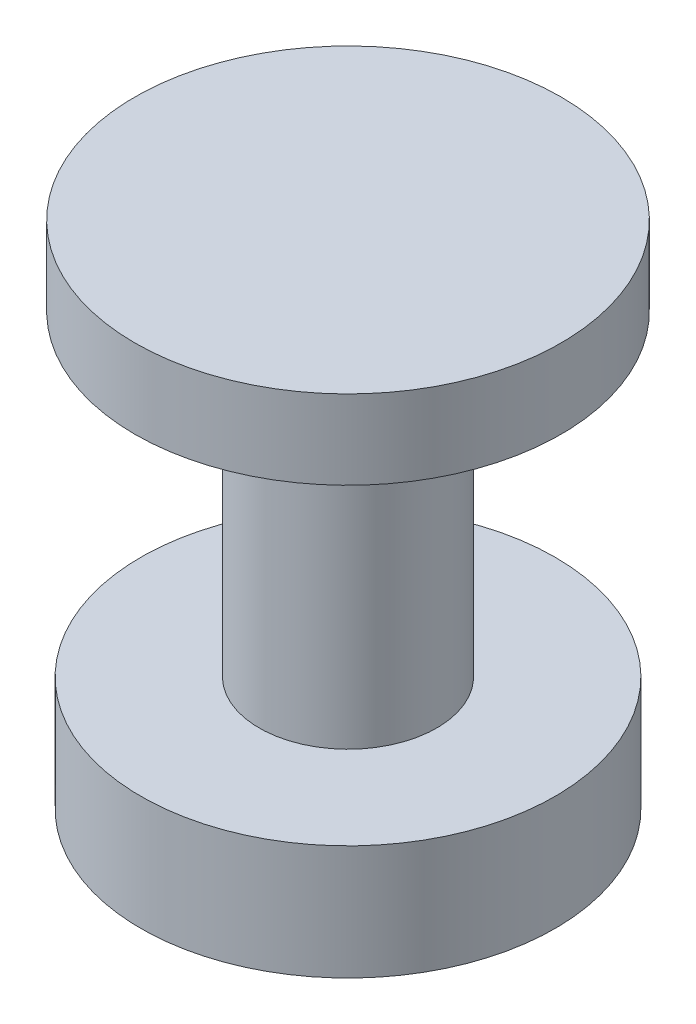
from build123d import *


with BuildPart() as part:
    # Sketch2 → Base-Revolve (revolve)
    with BuildSketch(Plane.XY, mode=Mode.PRIVATE) as base_revolve_sk:
        Polygon((0, 32.265731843), (13.479144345, 32.265731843), (13.479144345, 27.260900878), (5.61771873, 27.260900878), (5.61771873, 7.241577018), (13.10122441, 7.241577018), (13.10122441, 0), (0, 0), align=None)
    revolve(base_revolve_sk.sketch.rotate(Axis((0, 0, 0), (0, 1, 0)), 90), axis=Axis((0, 0, 0), (0, 1, 0)))


solid = part.part
